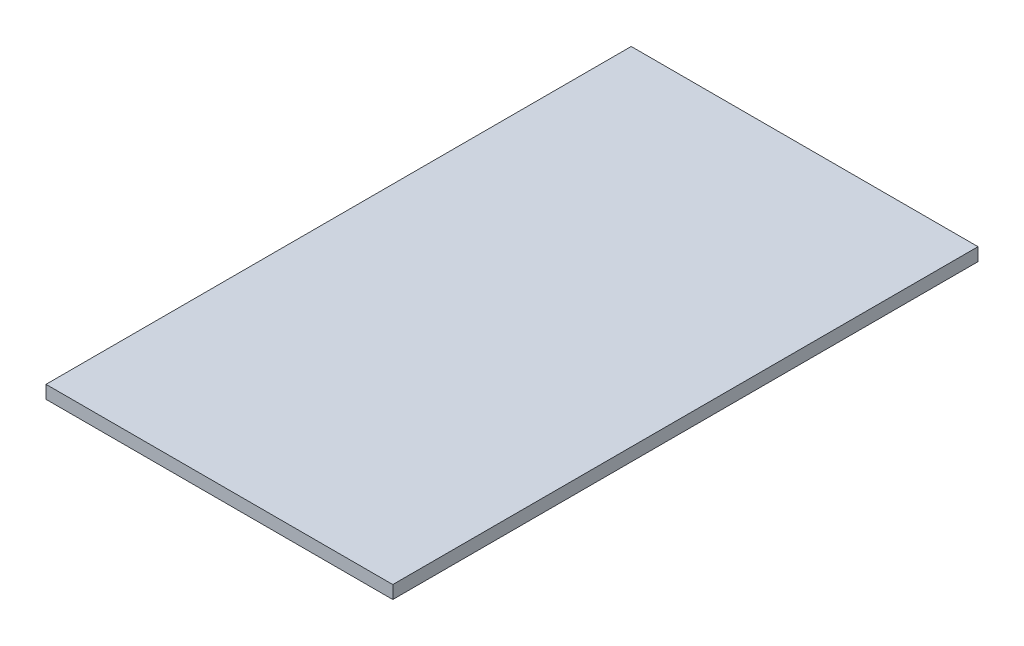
ISO-10303-21;
HEADER;
FILE_DESCRIPTION(('STEP AP214'),'2;1');
FILE_NAME('part.step','',(''),(''),'','','');
FILE_SCHEMA(('AUTOMOTIVE_DESIGN { 1 0 10303 214 1 1 1 1 }'));
ENDSEC;
DATA;
#1=APPLICATION_CONTEXT('core data for automotive mechanical design processes');
#2=APPLICATION_PROTOCOL_DEFINITION('international standard','automotive_design',2000,#1);
#3=PRODUCT_CONTEXT('',#1,'mechanical');
#4=PRODUCT('Part','Part','',(#3));
#5=PRODUCT_RELATED_PRODUCT_CATEGORY('part','',(#4));
#6=PRODUCT_DEFINITION_FORMATION('','',#4);
#7=PRODUCT_DEFINITION_CONTEXT('part definition',#1,'design');
#8=PRODUCT_DEFINITION('design','',#6,#7);
#9=PRODUCT_DEFINITION_SHAPE('','',#8);
#10=(LENGTH_UNIT() NAMED_UNIT(*) SI_UNIT(.MILLI.,.METRE.));
#11=(NAMED_UNIT(*) PLANE_ANGLE_UNIT() SI_UNIT($,.RADIAN.));
#12=(NAMED_UNIT(*) SI_UNIT($,.STERADIAN.) SOLID_ANGLE_UNIT());
#13=UNCERTAINTY_MEASURE_WITH_UNIT(LENGTH_MEASURE(1.E-05),#10,'distance_accuracy_value','');
#14=(GEOMETRIC_REPRESENTATION_CONTEXT(3) GLOBAL_UNCERTAINTY_ASSIGNED_CONTEXT((#13)) GLOBAL_UNIT_ASSIGNED_CONTEXT((#10,
#11,#12)) REPRESENTATION_CONTEXT('',''));
#15=CARTESIAN_POINT('',(0.,0.,0.));
#16=DIRECTION('',(0.,0.,1.));
#17=DIRECTION('',(1.,0.,0.));
#18=AXIS2_PLACEMENT_3D('',#15,#16,#17);
#19=CARTESIAN_POINT('',(0.,0.,67.5));
#20=DIRECTION('',(1.,0.,0.));
#21=DIRECTION('',(0.,0.,-1.));
#22=AXIS2_PLACEMENT_3D('',#19,#20,#21);
#23=PLANE('',#22);
#24=DIRECTION('',(0.,-1.,0.));
#25=VECTOR('',#24,1.);
#26=CARTESIAN_POINT('',(0.,0.,0.));
#27=LINE('',#26,#25);
#28=CARTESIAN_POINT('',(0.,1.5,0.));
#29=VERTEX_POINT('',#28);
#30=CARTESIAN_POINT('',(0.,0.,0.));
#31=VERTEX_POINT('',#30);
#32=EDGE_CURVE('E78',#29,#31,#27,.T.);
#33=ORIENTED_EDGE('',*,*,#32,.T.);
#34=DIRECTION('',(0.,0.,-1.));
#35=VECTOR('',#34,1.);
#36=CARTESIAN_POINT('',(0.,0.,67.5));
#37=LINE('',#36,#35);
#38=CARTESIAN_POINT('',(0.,0.,67.5));
#39=VERTEX_POINT('',#38);
#40=EDGE_CURVE('E11',#39,#31,#37,.T.);
#41=ORIENTED_EDGE('',*,*,#40,.F.);
#42=DIRECTION('',(0.,-1.,0.));
#43=VECTOR('',#42,1.);
#44=CARTESIAN_POINT('',(0.,0.,67.5));
#45=LINE('',#44,#43);
#46=CARTESIAN_POINT('',(0.,1.5,67.5));
#47=VERTEX_POINT('',#46);
#48=EDGE_CURVE('E96',#47,#39,#45,.T.);
#49=ORIENTED_EDGE('',*,*,#48,.F.);
#50=DIRECTION('',(0.,0.,-1.));
#51=VECTOR('',#50,1.);
#52=CARTESIAN_POINT('',(0.,1.5,67.5));
#53=LINE('',#52,#51);
#54=EDGE_CURVE('E90',#47,#29,#53,.T.);
#55=ORIENTED_EDGE('',*,*,#54,.T.);
#56=EDGE_LOOP('',(#33,#41,#49,#55));
#57=FACE_BOUND('',#56,.T.);
#58=ADVANCED_FACE('F34',(#57),#23,.F.);
#59=CARTESIAN_POINT('',(0.,0.,67.5));
#60=DIRECTION('',(0.,1.,0.));
#61=DIRECTION('',(0.,0.,1.));
#62=AXIS2_PLACEMENT_3D('',#59,#60,#61);
#63=PLANE('',#62);
#64=DIRECTION('',(1.,0.,0.));
#65=VECTOR('',#64,1.);
#66=CARTESIAN_POINT('',(0.,0.,0.));
#67=LINE('',#66,#65);
#68=CARTESIAN_POINT('',(40.,0.,0.));
#69=VERTEX_POINT('',#68);
#70=EDGE_CURVE('E74',#31,#69,#67,.T.);
#71=ORIENTED_EDGE('',*,*,#70,.T.);
#72=DIRECTION('',(0.,0.,-1.));
#73=VECTOR('',#72,1.);
#74=CARTESIAN_POINT('',(40.,0.,67.5));
#75=LINE('',#74,#73);
#76=CARTESIAN_POINT('',(40.,0.,67.5));
#77=VERTEX_POINT('',#76);
#78=EDGE_CURVE('E41',#77,#69,#75,.T.);
#79=ORIENTED_EDGE('',*,*,#78,.F.);
#80=DIRECTION('',(1.,0.,0.));
#81=VECTOR('',#80,1.);
#82=CARTESIAN_POINT('',(0.,0.,67.5));
#83=LINE('',#82,#81);
#84=EDGE_CURVE('E86',#39,#77,#83,.T.);
#85=ORIENTED_EDGE('',*,*,#84,.F.);
#86=ORIENTED_EDGE('',*,*,#40,.T.);
#87=EDGE_LOOP('',(#71,#79,#85,#86));
#88=FACE_BOUND('',#87,.T.);
#89=ADVANCED_FACE('F85',(#88),#63,.F.);
#90=CARTESIAN_POINT('',(40.,0.,67.5));
#91=DIRECTION('',(-1.,0.,0.));
#92=DIRECTION('',(0.,-1.,0.));
#93=AXIS2_PLACEMENT_3D('',#90,#91,#92);
#94=PLANE('',#93);
#95=DIRECTION('',(0.,1.,0.));
#96=VECTOR('',#95,1.);
#97=CARTESIAN_POINT('',(40.,0.,0.));
#98=LINE('',#97,#96);
#99=CARTESIAN_POINT('',(40.,1.5,0.));
#100=VERTEX_POINT('',#99);
#101=EDGE_CURVE('E79',#69,#100,#98,.T.);
#102=ORIENTED_EDGE('',*,*,#101,.T.);
#103=DIRECTION('',(0.,0.,-1.));
#104=VECTOR('',#103,1.);
#105=CARTESIAN_POINT('',(40.,1.5,67.5));
#106=LINE('',#105,#104);
#107=CARTESIAN_POINT('',(40.,1.5,67.5));
#108=VERTEX_POINT('',#107);
#109=EDGE_CURVE('E102',#108,#100,#106,.T.);
#110=ORIENTED_EDGE('',*,*,#109,.F.);
#111=DIRECTION('',(0.,1.,0.));
#112=VECTOR('',#111,1.);
#113=CARTESIAN_POINT('',(40.,0.,67.5));
#114=LINE('',#113,#112);
#115=EDGE_CURVE('E53',#77,#108,#114,.T.);
#116=ORIENTED_EDGE('',*,*,#115,.F.);
#117=ORIENTED_EDGE('',*,*,#78,.T.);
#118=EDGE_LOOP('',(#102,#110,#116,#117));
#119=FACE_BOUND('',#118,.T.);
#120=ADVANCED_FACE('F105',(#119),#94,.F.);
#121=CARTESIAN_POINT('',(0.,1.5,67.5));
#122=DIRECTION('',(0.,-1.,0.));
#123=DIRECTION('',(0.,0.,-1.));
#124=AXIS2_PLACEMENT_3D('',#121,#122,#123);
#125=PLANE('',#124);
#126=DIRECTION('',(-1.,0.,0.));
#127=VECTOR('',#126,1.);
#128=CARTESIAN_POINT('',(0.,1.5,0.));
#129=LINE('',#128,#127);
#130=EDGE_CURVE('E94',#100,#29,#129,.T.);
#131=ORIENTED_EDGE('',*,*,#130,.T.);
#132=ORIENTED_EDGE('',*,*,#54,.F.);
#133=DIRECTION('',(-1.,0.,0.));
#134=VECTOR('',#133,1.);
#135=CARTESIAN_POINT('',(0.,1.5,67.5));
#136=LINE('',#135,#134);
#137=EDGE_CURVE('E48',#108,#47,#136,.T.);
#138=ORIENTED_EDGE('',*,*,#137,.F.);
#139=ORIENTED_EDGE('',*,*,#109,.T.);
#140=EDGE_LOOP('',(#131,#132,#138,#139));
#141=FACE_BOUND('',#140,.T.);
#142=ADVANCED_FACE('F107',(#141),#125,.F.);
#143=CARTESIAN_POINT('',(0.,1.5,67.5));
#144=DIRECTION('',(0.,0.,-1.));
#145=DIRECTION('',(-1.,0.,0.));
#146=AXIS2_PLACEMENT_3D('',#143,#144,#145);
#147=PLANE('',#146);
#148=ORIENTED_EDGE('',*,*,#48,.T.);
#149=ORIENTED_EDGE('',*,*,#84,.T.);
#150=ORIENTED_EDGE('',*,*,#115,.T.);
#151=ORIENTED_EDGE('',*,*,#137,.T.);
#152=EDGE_LOOP('',(#148,#149,#150,#151));
#153=FACE_BOUND('',#152,.T.);
#154=ADVANCED_FACE('F108',(#153),#147,.F.);
#155=CARTESIAN_POINT('',(0.,1.5,0.));
#156=DIRECTION('',(0.,0.,-1.));
#157=DIRECTION('',(-1.,0.,0.));
#158=AXIS2_PLACEMENT_3D('',#155,#156,#157);
#159=PLANE('',#158);
#160=ORIENTED_EDGE('',*,*,#32,.F.);
#161=ORIENTED_EDGE('',*,*,#130,.F.);
#162=ORIENTED_EDGE('',*,*,#101,.F.);
#163=ORIENTED_EDGE('',*,*,#70,.F.);
#164=EDGE_LOOP('',(#160,#161,#162,#163));
#165=FACE_BOUND('',#164,.T.);
#166=ADVANCED_FACE('F75',(#165),#159,.T.);
#167=CLOSED_SHELL('',(#58,#89,#120,#142,#154,#166));
#168=MANIFOLD_SOLID_BREP('B2',#167);
#169=ADVANCED_BREP_SHAPE_REPRESENTATION('',(#18,#168),#14);
#170=SHAPE_DEFINITION_REPRESENTATION(#9,#169);
ENDSEC;
END-ISO-10303-21;
